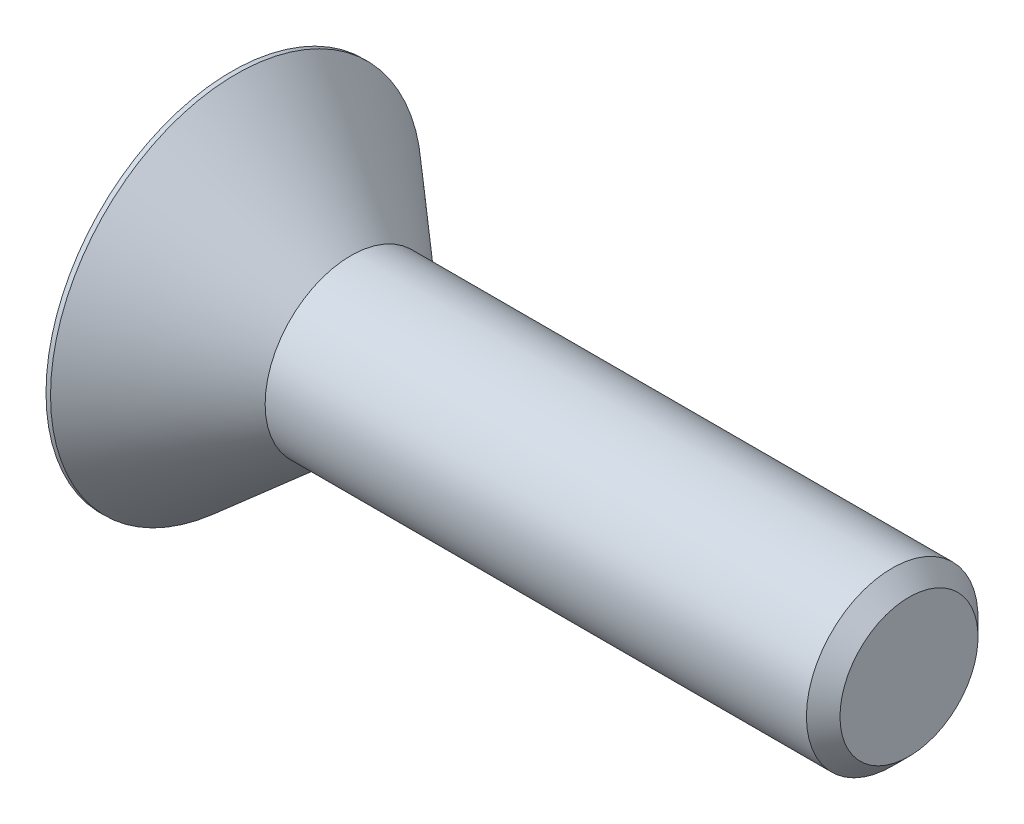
ISO-10303-21;
HEADER;
FILE_DESCRIPTION(('STEP AP214'),'2;1');
FILE_NAME('part.step','',(''),(''),'','','');
FILE_SCHEMA(('AUTOMOTIVE_DESIGN { 1 0 10303 214 1 1 1 1 }'));
ENDSEC;
DATA;
#1=APPLICATION_CONTEXT('core data for automotive mechanical design processes');
#2=APPLICATION_PROTOCOL_DEFINITION('international standard','automotive_design',2000,#1);
#3=PRODUCT_CONTEXT('',#1,'mechanical');
#4=PRODUCT('Part','Part','',(#3));
#5=PRODUCT_RELATED_PRODUCT_CATEGORY('part','',(#4));
#6=PRODUCT_DEFINITION_FORMATION('','',#4);
#7=PRODUCT_DEFINITION_CONTEXT('part definition',#1,'design');
#8=PRODUCT_DEFINITION('design','',#6,#7);
#9=PRODUCT_DEFINITION_SHAPE('','',#8);
#10=(LENGTH_UNIT() NAMED_UNIT(*) SI_UNIT(.MILLI.,.METRE.));
#11=(NAMED_UNIT(*) PLANE_ANGLE_UNIT() SI_UNIT($,.RADIAN.));
#12=(NAMED_UNIT(*) SI_UNIT($,.STERADIAN.) SOLID_ANGLE_UNIT());
#13=UNCERTAINTY_MEASURE_WITH_UNIT(LENGTH_MEASURE(1.E-05),#10,'distance_accuracy_value','');
#14=(GEOMETRIC_REPRESENTATION_CONTEXT(3) GLOBAL_UNCERTAINTY_ASSIGNED_CONTEXT((#13)) GLOBAL_UNIT_ASSIGNED_CONTEXT((#10,
#11,#12)) REPRESENTATION_CONTEXT('',''));
#15=CARTESIAN_POINT('',(0.,0.,0.));
#16=DIRECTION('',(0.,0.,1.));
#17=DIRECTION('',(1.,0.,0.));
#18=AXIS2_PLACEMENT_3D('',#15,#16,#17);
#19=CARTESIAN_POINT('',(0.,0.,0.));
#20=DIRECTION('',(-1.,0.,0.));
#21=DIRECTION('',(0.,0.,1.));
#22=AXIS2_PLACEMENT_3D('',#19,#20,#21);
#23=PLANE('',#22);
#24=CARTESIAN_POINT('',(0.,0.,0.));
#25=DIRECTION('',(-1.,0.,0.));
#26=DIRECTION('',(0.,0.,1.));
#27=AXIS2_PLACEMENT_3D('',#24,#25,#26);
#28=CIRCLE('',#27,5.2197);
#29=CARTESIAN_POINT('',(0.,0.,5.2197));
#30=VERTEX_POINT('',#29);
#31=EDGE_CURVE('E149',#30,#30,#28,.T.);
#32=ORIENTED_EDGE('',*,*,#31,.T.);
#33=EDGE_LOOP('',(#32));
#34=FACE_BOUND('',#33,.T.);
#35=DIRECTION('',(0.,-0.500000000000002,-0.866025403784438));
#36=VECTOR('',#35,1.);
#37=CARTESIAN_POINT('',(0.,-0.916543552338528,1.5875));
#38=LINE('',#37,#36);
#39=CARTESIAN_POINT('',(0.,-0.916543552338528,1.5875));
#40=VERTEX_POINT('',#39);
#41=CARTESIAN_POINT('',(0.,-1.83308710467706,0.));
#42=VERTEX_POINT('',#41);
#43=EDGE_CURVE('E121',#40,#42,#38,.T.);
#44=ORIENTED_EDGE('',*,*,#43,.T.);
#45=DIRECTION('',(0.,0.500000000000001,-0.866025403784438));
#46=VECTOR('',#45,1.);
#47=CARTESIAN_POINT('',(0.,-1.83308710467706,0.));
#48=LINE('',#47,#46);
#49=CARTESIAN_POINT('',(0.,-0.91654355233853,-1.5875));
#50=VERTEX_POINT('',#49);
#51=EDGE_CURVE('E51',#42,#50,#48,.T.);
#52=ORIENTED_EDGE('',*,*,#51,.T.);
#53=DIRECTION('',(0.,1.,0.));
#54=VECTOR('',#53,1.);
#55=CARTESIAN_POINT('',(0.,-0.91654355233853,-1.5875));
#56=LINE('',#55,#54);
#57=CARTESIAN_POINT('',(0.,0.91654355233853,-1.5875));
#58=VERTEX_POINT('',#57);
#59=EDGE_CURVE('E136',#50,#58,#56,.T.);
#60=ORIENTED_EDGE('',*,*,#59,.T.);
#61=DIRECTION('',(0.,0.5,0.866025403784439));
#62=VECTOR('',#61,1.);
#63=CARTESIAN_POINT('',(0.,0.91654355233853,-1.5875));
#64=LINE('',#63,#62);
#65=CARTESIAN_POINT('',(0.,1.83308710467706,0.));
#66=VERTEX_POINT('',#65);
#67=EDGE_CURVE('E324',#58,#66,#64,.T.);
#68=ORIENTED_EDGE('',*,*,#67,.T.);
#69=DIRECTION('',(0.,-0.499999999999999,0.866025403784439));
#70=VECTOR('',#69,1.);
#71=CARTESIAN_POINT('',(0.,1.83308710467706,0.));
#72=LINE('',#71,#70);
#73=CARTESIAN_POINT('',(0.,0.91654355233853,1.5875));
#74=VERTEX_POINT('',#73);
#75=EDGE_CURVE('E327',#66,#74,#72,.T.);
#76=ORIENTED_EDGE('',*,*,#75,.T.);
#77=DIRECTION('',(0.,-1.,0.));
#78=VECTOR('',#77,1.);
#79=CARTESIAN_POINT('',(0.,0.91654355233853,1.5875));
#80=LINE('',#79,#78);
#81=EDGE_CURVE('E330',#74,#40,#80,.T.);
#82=ORIENTED_EDGE('',*,*,#81,.T.);
#83=EDGE_LOOP('',(#44,#52,#60,#68,#76,#82));
#84=FACE_BOUND('',#83,.T.);
#85=ADVANCED_FACE('F36',(#34,#84),#23,.T.);
#86=CARTESIAN_POINT('',(19.05,1.94056,0.));
#87=DIRECTION('',(1.,0.,0.));
#88=DIRECTION('',(0.,0.,-1.));
#89=AXIS2_PLACEMENT_3D('',#86,#87,#88);
#90=PLANE('',#89);
#91=CARTESIAN_POINT('',(19.05,0.,0.));
#92=DIRECTION('',(-1.,0.,0.));
#93=DIRECTION('',(0.,0.,1.));
#94=AXIS2_PLACEMENT_3D('',#91,#92,#93);
#95=CIRCLE('',#94,1.94056);
#96=CARTESIAN_POINT('',(19.05,0.,1.94056));
#97=VERTEX_POINT('',#96);
#98=EDGE_CURVE('E11',#97,#97,#95,.T.);
#99=ORIENTED_EDGE('',*,*,#98,.F.);
#100=EDGE_LOOP('',(#99));
#101=FACE_BOUND('',#100,.T.);
#102=ADVANCED_FACE('F38',(#101),#90,.T.);
#103=CARTESIAN_POINT('',(19.05,0.,0.));
#104=DIRECTION('',(-1.,0.,0.));
#105=DIRECTION('',(0.,0.,1.));
#106=AXIS2_PLACEMENT_3D('',#103,#104,#105);
#107=CONICAL_SURFACE('',#106,1.94056,0.785398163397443);
#108=CARTESIAN_POINT('',(18.57756,0.,0.));
#109=DIRECTION('',(-1.,0.,0.));
#110=DIRECTION('',(0.,0.,1.));
#111=AXIS2_PLACEMENT_3D('',#108,#109,#110);
#112=CIRCLE('',#111,2.413);
#113=CARTESIAN_POINT('',(18.57756,0.,2.413));
#114=VERTEX_POINT('',#113);
#115=EDGE_CURVE('E44',#114,#114,#112,.T.);
#116=ORIENTED_EDGE('',*,*,#115,.F.);
#117=EDGE_LOOP('',(#116));
#118=FACE_BOUND('',#117,.T.);
#119=ORIENTED_EDGE('',*,*,#98,.T.);
#120=EDGE_LOOP('',(#119));
#121=FACE_BOUND('',#120,.T.);
#122=ADVANCED_FACE('F164',(#118,#121),#107,.T.);
#123=CARTESIAN_POINT('',(0.,0.,0.));
#124=DIRECTION('',(-1.,0.,0.));
#125=DIRECTION('',(0.,0.,1.));
#126=AXIS2_PLACEMENT_3D('',#123,#124,#125);
#127=CYLINDRICAL_SURFACE('',#126,2.413);
#128=ORIENTED_EDGE('',*,*,#115,.T.);
#129=EDGE_LOOP('',(#128));
#130=FACE_BOUND('',#129,.T.);
#131=CARTESIAN_POINT('',(3.3557390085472,0.,0.));
#132=DIRECTION('',(-1.,0.,0.));
#133=DIRECTION('',(0.,0.,1.));
#134=AXIS2_PLACEMENT_3D('',#131,#132,#133);
#135=CIRCLE('',#134,2.413);
#136=CARTESIAN_POINT('',(3.3557390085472,0.,2.413));
#137=VERTEX_POINT('',#136);
#138=EDGE_CURVE('E156',#137,#137,#135,.T.);
#139=ORIENTED_EDGE('',*,*,#138,.F.);
#140=EDGE_LOOP('',(#139));
#141=FACE_BOUND('',#140,.T.);
#142=ADVANCED_FACE('F161',(#130,#141),#127,.T.);
#143=CARTESIAN_POINT('',(0.127000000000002,0.,0.));
#144=DIRECTION('',(-1.,0.,0.));
#145=DIRECTION('',(0.,0.,1.));
#146=AXIS2_PLACEMENT_3D('',#143,#144,#145);
#147=CONICAL_SURFACE('',#146,5.2197,0.715584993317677);
#148=ORIENTED_EDGE('',*,*,#138,.T.);
#149=EDGE_LOOP('',(#148));
#150=FACE_BOUND('',#149,.T.);
#151=CARTESIAN_POINT('',(0.127000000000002,0.,0.));
#152=DIRECTION('',(-1.,0.,0.));
#153=DIRECTION('',(0.,0.,1.));
#154=AXIS2_PLACEMENT_3D('',#151,#152,#153);
#155=CIRCLE('',#154,5.2197);
#156=CARTESIAN_POINT('',(0.127000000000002,0.,5.2197));
#157=VERTEX_POINT('',#156);
#158=EDGE_CURVE('E153',#157,#157,#155,.T.);
#159=ORIENTED_EDGE('',*,*,#158,.F.);
#160=EDGE_LOOP('',(#159));
#161=FACE_BOUND('',#160,.T.);
#162=ADVANCED_FACE('F185',(#150,#161),#147,.T.);
#163=CARTESIAN_POINT('',(0.,0.,0.));
#164=DIRECTION('',(-1.,0.,0.));
#165=DIRECTION('',(0.,0.,1.));
#166=AXIS2_PLACEMENT_3D('',#163,#164,#165);
#167=CYLINDRICAL_SURFACE('',#166,5.2197);
#168=ORIENTED_EDGE('',*,*,#158,.T.);
#169=EDGE_LOOP('',(#168));
#170=FACE_BOUND('',#169,.T.);
#171=ORIENTED_EDGE('',*,*,#31,.F.);
#172=EDGE_LOOP('',(#171));
#173=FACE_BOUND('',#172,.T.);
#174=ADVANCED_FACE('F182',(#170,#173),#167,.T.);
#175=CARTESIAN_POINT('',(2.2098,-1.83308710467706,0.));
#176=DIRECTION('',(0.,0.866025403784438,0.500000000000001));
#177=DIRECTION('',(0.,-0.500000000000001,0.866025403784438));
#178=AXIS2_PLACEMENT_3D('',#175,#176,#177);
#179=PLANE('',#178);
#180=ORIENTED_EDGE('',*,*,#51,.F.);
#181=DIRECTION('',(-1.,0.,0.));
#182=VECTOR('',#181,1.);
#183=CARTESIAN_POINT('',(2.2098,-1.83308710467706,0.));
#184=LINE('',#183,#182);
#185=CARTESIAN_POINT('',(2.2098,-1.83308710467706,0.));
#186=VERTEX_POINT('',#185);
#187=EDGE_CURVE('E321',#186,#42,#184,.T.);
#188=ORIENTED_EDGE('',*,*,#187,.F.);
#189=DIRECTION('',(0.,0.500000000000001,-0.866025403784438));
#190=VECTOR('',#189,1.);
#191=CARTESIAN_POINT('',(2.2098,-1.83308710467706,0.));
#192=LINE('',#191,#190);
#193=CARTESIAN_POINT('',(2.2098,-1.3748153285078,-0.793750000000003));
#194=VERTEX_POINT('',#193);
#195=EDGE_CURVE('E118',#186,#194,#192,.T.);
#196=ORIENTED_EDGE('',*,*,#195,.T.);
#197=CARTESIAN_POINT('',(2.2098,-0.91654355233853,-1.5875));
#198=VERTEX_POINT('',#197);
#199=EDGE_CURVE('E112',#194,#198,#192,.T.);
#200=ORIENTED_EDGE('',*,*,#199,.T.);
#201=DIRECTION('',(-1.,0.,0.));
#202=VECTOR('',#201,1.);
#203=CARTESIAN_POINT('',(2.2098,-0.91654355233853,-1.5875));
#204=LINE('',#203,#202);
#205=EDGE_CURVE('E116',#198,#50,#204,.T.);
#206=ORIENTED_EDGE('',*,*,#205,.T.);
#207=EDGE_LOOP('',(#180,#188,#196,#200,#206));
#208=FACE_BOUND('',#207,.T.);
#209=ADVANCED_FACE('F114',(#208),#179,.T.);
#210=CARTESIAN_POINT('',(2.2098,-0.91654355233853,-1.5875));
#211=DIRECTION('',(0.,0.,1.));
#212=DIRECTION('',(1.,0.,0.));
#213=AXIS2_PLACEMENT_3D('',#210,#211,#212);
#214=PLANE('',#213);
#215=ORIENTED_EDGE('',*,*,#59,.F.);
#216=ORIENTED_EDGE('',*,*,#205,.F.);
#217=DIRECTION('',(0.,1.,0.));
#218=VECTOR('',#217,1.);
#219=CARTESIAN_POINT('',(2.2098,-0.91654355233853,-1.5875));
#220=LINE('',#219,#218);
#221=CARTESIAN_POINT('',(2.2098,0.,-1.5875));
#222=VERTEX_POINT('',#221);
#223=EDGE_CURVE('E124',#198,#222,#220,.T.);
#224=ORIENTED_EDGE('',*,*,#223,.T.);
#225=CARTESIAN_POINT('',(2.2098,0.91654355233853,-1.5875));
#226=VERTEX_POINT('',#225);
#227=EDGE_CURVE('E131',#222,#226,#220,.T.);
#228=ORIENTED_EDGE('',*,*,#227,.T.);
#229=DIRECTION('',(-1.,0.,0.));
#230=VECTOR('',#229,1.);
#231=CARTESIAN_POINT('',(2.2098,0.91654355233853,-1.5875));
#232=LINE('',#231,#230);
#233=EDGE_CURVE('E138',#226,#58,#232,.T.);
#234=ORIENTED_EDGE('',*,*,#233,.T.);
#235=EDGE_LOOP('',(#215,#216,#224,#228,#234));
#236=FACE_BOUND('',#235,.T.);
#237=ADVANCED_FACE('F133',(#236),#214,.T.);
#238=CARTESIAN_POINT('',(2.2098,0.91654355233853,-1.5875));
#239=DIRECTION('',(0.,-0.866025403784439,0.5));
#240=DIRECTION('',(0.,-0.5,-0.866025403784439));
#241=AXIS2_PLACEMENT_3D('',#238,#239,#240);
#242=PLANE('',#241);
#243=ORIENTED_EDGE('',*,*,#67,.F.);
#244=ORIENTED_EDGE('',*,*,#233,.F.);
#245=DIRECTION('',(0.,0.5,0.866025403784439));
#246=VECTOR('',#245,1.);
#247=CARTESIAN_POINT('',(2.2098,0.91654355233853,-1.5875));
#248=LINE('',#247,#246);
#249=CARTESIAN_POINT('',(2.2098,1.3748153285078,-0.793749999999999));
#250=VERTEX_POINT('',#249);
#251=EDGE_CURVE('E342',#226,#250,#248,.T.);
#252=ORIENTED_EDGE('',*,*,#251,.T.);
#253=CARTESIAN_POINT('',(2.2098,1.83308710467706,0.));
#254=VERTEX_POINT('',#253);
#255=EDGE_CURVE('E130',#250,#254,#248,.T.);
#256=ORIENTED_EDGE('',*,*,#255,.T.);
#257=DIRECTION('',(-1.,0.,0.));
#258=VECTOR('',#257,1.);
#259=CARTESIAN_POINT('',(2.2098,1.83308710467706,0.));
#260=LINE('',#259,#258);
#261=EDGE_CURVE('E144',#254,#66,#260,.T.);
#262=ORIENTED_EDGE('',*,*,#261,.T.);
#263=EDGE_LOOP('',(#243,#244,#252,#256,#262));
#264=FACE_BOUND('',#263,.T.);
#265=ADVANCED_FACE('F215',(#264),#242,.T.);
#266=CARTESIAN_POINT('',(2.2098,1.83308710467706,0.));
#267=DIRECTION('',(0.,-0.866025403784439,-0.499999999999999));
#268=DIRECTION('',(0.,0.499999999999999,-0.866025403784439));
#269=AXIS2_PLACEMENT_3D('',#266,#267,#268);
#270=PLANE('',#269);
#271=ORIENTED_EDGE('',*,*,#75,.F.);
#272=ORIENTED_EDGE('',*,*,#261,.F.);
#273=DIRECTION('',(0.,-0.499999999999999,0.866025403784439));
#274=VECTOR('',#273,1.);
#275=CARTESIAN_POINT('',(2.2098,1.83308710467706,0.));
#276=LINE('',#275,#274);
#277=CARTESIAN_POINT('',(2.2098,1.3748153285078,0.793749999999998));
#278=VERTEX_POINT('',#277);
#279=EDGE_CURVE('E59',#254,#278,#276,.T.);
#280=ORIENTED_EDGE('',*,*,#279,.T.);
#281=CARTESIAN_POINT('',(2.2098,0.91654355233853,1.5875));
#282=VERTEX_POINT('',#281);
#283=EDGE_CURVE('E304',#278,#282,#276,.T.);
#284=ORIENTED_EDGE('',*,*,#283,.T.);
#285=DIRECTION('',(-1.,0.,0.));
#286=VECTOR('',#285,1.);
#287=CARTESIAN_POINT('',(2.2098,0.91654355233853,1.5875));
#288=LINE('',#287,#286);
#289=EDGE_CURVE('E315',#282,#74,#288,.T.);
#290=ORIENTED_EDGE('',*,*,#289,.T.);
#291=EDGE_LOOP('',(#271,#272,#280,#284,#290));
#292=FACE_BOUND('',#291,.T.);
#293=ADVANCED_FACE('F222',(#292),#270,.T.);
#294=CARTESIAN_POINT('',(2.2098,0.91654355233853,1.5875));
#295=DIRECTION('',(0.,0.,-1.));
#296=DIRECTION('',(0.,1.,0.));
#297=AXIS2_PLACEMENT_3D('',#294,#295,#296);
#298=PLANE('',#297);
#299=ORIENTED_EDGE('',*,*,#81,.F.);
#300=ORIENTED_EDGE('',*,*,#289,.F.);
#301=DIRECTION('',(0.,-1.,0.));
#302=VECTOR('',#301,1.);
#303=CARTESIAN_POINT('',(2.2098,0.91654355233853,1.5875));
#304=LINE('',#303,#302);
#305=CARTESIAN_POINT('',(2.2098,0.,1.5875));
#306=VERTEX_POINT('',#305);
#307=EDGE_CURVE('E303',#282,#306,#304,.T.);
#308=ORIENTED_EDGE('',*,*,#307,.T.);
#309=CARTESIAN_POINT('',(2.2098,-0.916543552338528,1.5875));
#310=VERTEX_POINT('',#309);
#311=EDGE_CURVE('E306',#306,#310,#304,.T.);
#312=ORIENTED_EDGE('',*,*,#311,.T.);
#313=DIRECTION('',(-1.,0.,0.));
#314=VECTOR('',#313,1.);
#315=CARTESIAN_POINT('',(2.2098,-0.916543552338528,1.5875));
#316=LINE('',#315,#314);
#317=EDGE_CURVE('E336',#310,#40,#316,.T.);
#318=ORIENTED_EDGE('',*,*,#317,.T.);
#319=EDGE_LOOP('',(#299,#300,#308,#312,#318));
#320=FACE_BOUND('',#319,.T.);
#321=ADVANCED_FACE('F230',(#320),#298,.T.);
#322=CARTESIAN_POINT('',(2.2098,-0.916543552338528,1.5875));
#323=DIRECTION('',(0.,0.866025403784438,-0.500000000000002));
#324=DIRECTION('',(0.,0.500000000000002,0.866025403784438));
#325=AXIS2_PLACEMENT_3D('',#322,#323,#324);
#326=PLANE('',#325);
#327=ORIENTED_EDGE('',*,*,#43,.F.);
#328=ORIENTED_EDGE('',*,*,#317,.F.);
#329=DIRECTION('',(0.,-0.500000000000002,-0.866025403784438));
#330=VECTOR('',#329,1.);
#331=CARTESIAN_POINT('',(2.2098,-0.916543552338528,1.5875));
#332=LINE('',#331,#330);
#333=CARTESIAN_POINT('',(2.2098,-1.3748153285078,0.793750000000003));
#334=VERTEX_POINT('',#333);
#335=EDGE_CURVE('E309',#310,#334,#332,.T.);
#336=ORIENTED_EDGE('',*,*,#335,.T.);
#337=EDGE_CURVE('E316',#334,#186,#332,.T.);
#338=ORIENTED_EDGE('',*,*,#337,.T.);
#339=ORIENTED_EDGE('',*,*,#187,.T.);
#340=EDGE_LOOP('',(#327,#328,#336,#338,#339));
#341=FACE_BOUND('',#340,.T.);
#342=ADVANCED_FACE('F237',(#341),#326,.T.);
#343=CARTESIAN_POINT('',(2.2098,-1.83308710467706,0.));
#344=DIRECTION('',(-1.,0.,0.));
#345=DIRECTION('',(0.,0.,1.));
#346=AXIS2_PLACEMENT_3D('',#343,#344,#345);
#347=PLANE('',#346);
#348=CARTESIAN_POINT('',(2.2098,0.,0.));
#349=DIRECTION('',(-1.,0.,0.));
#350=DIRECTION('',(0.,0.,1.));
#351=AXIS2_PLACEMENT_3D('',#348,#349,#350);
#352=CIRCLE('',#351,1.5875);
#353=EDGE_CURVE('E137',#334,#306,#352,.T.);
#354=ORIENTED_EDGE('',*,*,#353,.F.);
#355=ORIENTED_EDGE('',*,*,#335,.F.);
#356=ORIENTED_EDGE('',*,*,#311,.F.);
#357=EDGE_LOOP('',(#354,#355,#356));
#358=FACE_BOUND('',#357,.T.);
#359=ADVANCED_FACE('F245',(#358),#347,.T.);
#360=EDGE_CURVE('E141',#194,#334,#352,.T.);
#361=ORIENTED_EDGE('',*,*,#360,.F.);
#362=ORIENTED_EDGE('',*,*,#195,.F.);
#363=ORIENTED_EDGE('',*,*,#337,.F.);
#364=EDGE_LOOP('',(#361,#362,#363));
#365=FACE_BOUND('',#364,.T.);
#366=ADVANCED_FACE('F253',(#365),#347,.T.);
#367=EDGE_CURVE('E126',#222,#194,#352,.T.);
#368=ORIENTED_EDGE('',*,*,#367,.F.);
#369=ORIENTED_EDGE('',*,*,#223,.F.);
#370=ORIENTED_EDGE('',*,*,#199,.F.);
#371=EDGE_LOOP('',(#368,#369,#370));
#372=FACE_BOUND('',#371,.T.);
#373=ADVANCED_FACE('F125',(#372),#347,.T.);
#374=EDGE_CURVE('E344',#250,#222,#352,.T.);
#375=ORIENTED_EDGE('',*,*,#374,.F.);
#376=ORIENTED_EDGE('',*,*,#251,.F.);
#377=ORIENTED_EDGE('',*,*,#227,.F.);
#378=EDGE_LOOP('',(#375,#376,#377));
#379=FACE_BOUND('',#378,.T.);
#380=ADVANCED_FACE('F268',(#379),#347,.T.);
#381=EDGE_CURVE('E150',#278,#250,#352,.T.);
#382=ORIENTED_EDGE('',*,*,#381,.F.);
#383=ORIENTED_EDGE('',*,*,#279,.F.);
#384=ORIENTED_EDGE('',*,*,#255,.F.);
#385=EDGE_LOOP('',(#382,#383,#384));
#386=FACE_BOUND('',#385,.T.);
#387=ADVANCED_FACE('F274',(#386),#347,.T.);
#388=EDGE_CURVE('E143',#306,#278,#352,.T.);
#389=ORIENTED_EDGE('',*,*,#388,.F.);
#390=ORIENTED_EDGE('',*,*,#307,.F.);
#391=ORIENTED_EDGE('',*,*,#283,.F.);
#392=EDGE_LOOP('',(#389,#390,#391));
#393=FACE_BOUND('',#392,.T.);
#394=ADVANCED_FACE('F256',(#393),#347,.T.);
#395=CARTESIAN_POINT('',(2.2098,0.,0.));
#396=DIRECTION('',(-1.,0.,0.));
#397=DIRECTION('',(0.,0.,1.));
#398=AXIS2_PLACEMENT_3D('',#395,#396,#397);
#399=CONICAL_SURFACE('',#398,1.5875,1.04719755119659);
#400=CARTESIAN_POINT('',(3.12634355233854,0.,0.));
#401=VERTEX_POINT('',#400);
#402=VERTEX_LOOP('',#401);
#403=FACE_BOUND('',#402,.T.);
#404=ORIENTED_EDGE('',*,*,#388,.T.);
#405=ORIENTED_EDGE('',*,*,#381,.T.);
#406=ORIENTED_EDGE('',*,*,#374,.T.);
#407=ORIENTED_EDGE('',*,*,#367,.T.);
#408=ORIENTED_EDGE('',*,*,#360,.T.);
#409=ORIENTED_EDGE('',*,*,#353,.T.);
#410=EDGE_LOOP('',(#404,#405,#406,#407,#408,#409));
#411=FACE_BOUND('',#410,.T.);
#412=ADVANCED_FACE('F180',(#403,#411),#399,.F.);
#413=CLOSED_SHELL('',(#85,#102,#122,#142,#162,#174,#209,#237,#265,#293,#321,#342,#359,#366,#373,
#380,#387,#394,#412));
#414=MANIFOLD_SOLID_BREP('B2',#413);
#415=ADVANCED_BREP_SHAPE_REPRESENTATION('',(#18,#414),#14);
#416=SHAPE_DEFINITION_REPRESENTATION(#9,#415);
ENDSEC;
END-ISO-10303-21;
